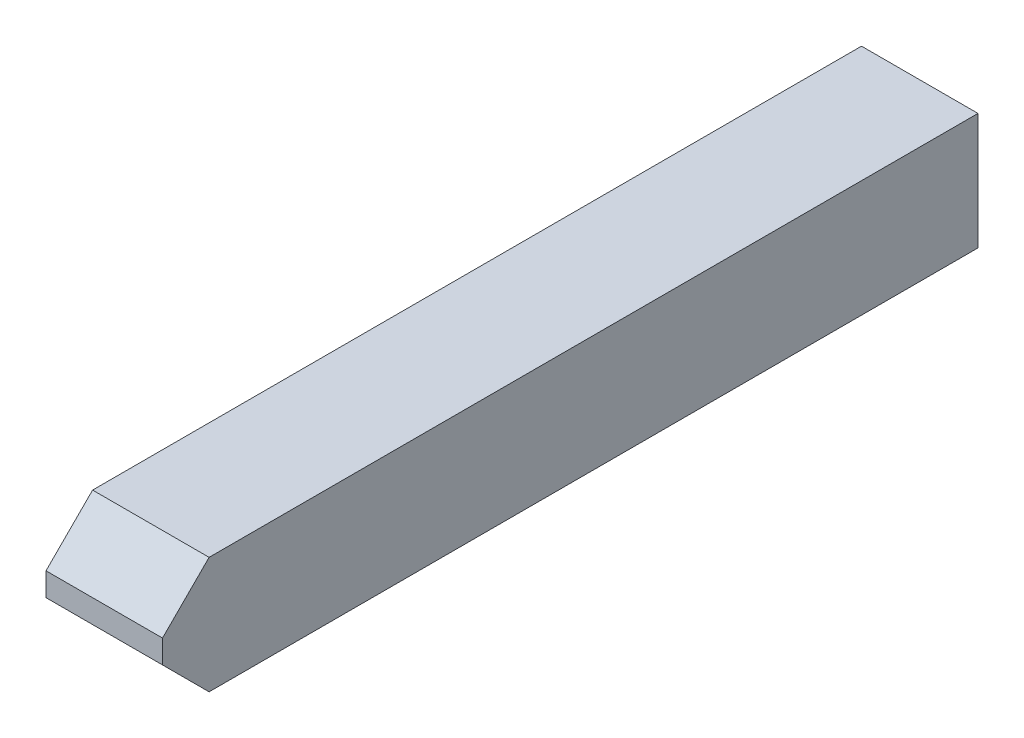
ISO-10303-21;
HEADER;
FILE_DESCRIPTION(('STEP AP214'),'2;1');
FILE_NAME('part.step','',(''),(''),'','','');
FILE_SCHEMA(('AUTOMOTIVE_DESIGN { 1 0 10303 214 1 1 1 1 }'));
ENDSEC;
DATA;
#1=APPLICATION_CONTEXT('core data for automotive mechanical design processes');
#2=APPLICATION_PROTOCOL_DEFINITION('international standard','automotive_design',2000,#1);
#3=PRODUCT_CONTEXT('',#1,'mechanical');
#4=PRODUCT('Part','Part','',(#3));
#5=PRODUCT_RELATED_PRODUCT_CATEGORY('part','',(#4));
#6=PRODUCT_DEFINITION_FORMATION('','',#4);
#7=PRODUCT_DEFINITION_CONTEXT('part definition',#1,'design');
#8=PRODUCT_DEFINITION('design','',#6,#7);
#9=PRODUCT_DEFINITION_SHAPE('','',#8);
#10=(LENGTH_UNIT() NAMED_UNIT(*) SI_UNIT(.MILLI.,.METRE.));
#11=(NAMED_UNIT(*) PLANE_ANGLE_UNIT() SI_UNIT($,.RADIAN.));
#12=(NAMED_UNIT(*) SI_UNIT($,.STERADIAN.) SOLID_ANGLE_UNIT());
#13=UNCERTAINTY_MEASURE_WITH_UNIT(LENGTH_MEASURE(1.E-05),#10,'distance_accuracy_value','');
#14=(GEOMETRIC_REPRESENTATION_CONTEXT(3) GLOBAL_UNCERTAINTY_ASSIGNED_CONTEXT((#13)) GLOBAL_UNIT_ASSIGNED_CONTEXT((#10,
#11,#12)) REPRESENTATION_CONTEXT('',''));
#15=CARTESIAN_POINT('',(0.,0.,0.));
#16=DIRECTION('',(0.,0.,1.));
#17=DIRECTION('',(1.,0.,0.));
#18=AXIS2_PLACEMENT_3D('',#15,#16,#17);
#19=CARTESIAN_POINT('',(2.,4.8,22.5));
#20=DIRECTION('',(1.,0.,0.));
#21=DIRECTION('',(0.,0.,-1.));
#22=AXIS2_PLACEMENT_3D('',#19,#20,#21);
#23=PLANE('',#22);
#24=DIRECTION('',(0.,1.,0.));
#25=VECTOR('',#24,1.);
#26=CARTESIAN_POINT('',(2.,4.8,26.));
#27=LINE('',#26,#25);
#28=CARTESIAN_POINT('',(2.,-1.,26.));
#29=VERTEX_POINT('',#28);
#30=CARTESIAN_POINT('',(2.,-0.9,26.));
#31=VERTEX_POINT('',#30);
#32=EDGE_CURVE('E74',#29,#31,#27,.T.);
#33=ORIENTED_EDGE('',*,*,#32,.F.);
#34=DIRECTION('',(0.,-0.707106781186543,-0.707106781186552));
#35=VECTOR('',#34,1.);
#36=CARTESIAN_POINT('',(2.,-1.,26.));
#37=LINE('',#36,#35);
#38=CARTESIAN_POINT('',(2.,-1.2,25.8));
#39=VERTEX_POINT('',#38);
#40=EDGE_CURVE('E20',#29,#39,#37,.T.);
#41=ORIENTED_EDGE('',*,*,#40,.T.);
#42=DIRECTION('',(0.,0.,-1.));
#43=VECTOR('',#42,1.);
#44=CARTESIAN_POINT('',(2.,-1.2,22.5));
#45=LINE('',#44,#43);
#46=CARTESIAN_POINT('',(2.,-1.2,22.5));
#47=VERTEX_POINT('',#46);
#48=EDGE_CURVE('E101',#47,#39,#45,.F.);
#49=ORIENTED_EDGE('',*,*,#48,.F.);
#50=DIRECTION('',(0.,1.,0.));
#51=VECTOR('',#50,1.);
#52=CARTESIAN_POINT('',(2.,4.8,22.5));
#53=LINE('',#52,#51);
#54=CARTESIAN_POINT('',(2.,-0.7,22.5));
#55=VERTEX_POINT('',#54);
#56=EDGE_CURVE('E94',#47,#55,#53,.T.);
#57=ORIENTED_EDGE('',*,*,#56,.T.);
#58=DIRECTION('',(0.,0.,1.));
#59=VECTOR('',#58,1.);
#60=CARTESIAN_POINT('',(2.,-0.7,22.5));
#61=LINE('',#60,#59);
#62=CARTESIAN_POINT('',(2.,-0.7,25.8));
#63=VERTEX_POINT('',#62);
#64=EDGE_CURVE('E68',#63,#55,#61,.F.);
#65=ORIENTED_EDGE('',*,*,#64,.F.);
#66=DIRECTION('',(0.,-0.707106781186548,0.707106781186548));
#67=VECTOR('',#66,1.);
#68=CARTESIAN_POINT('',(2.,-0.7,25.8));
#69=LINE('',#68,#67);
#70=EDGE_CURVE('E81',#31,#63,#69,.F.);
#71=ORIENTED_EDGE('',*,*,#70,.F.);
#72=EDGE_LOOP('',(#33,#41,#49,#57,#65,#71));
#73=FACE_BOUND('',#72,.T.);
#74=ADVANCED_FACE('F17',(#73),#23,.T.);
#75=CARTESIAN_POINT('',(2.,4.8,26.));
#76=DIRECTION('',(0.,0.,1.));
#77=DIRECTION('',(1.,0.,0.));
#78=AXIS2_PLACEMENT_3D('',#75,#76,#77);
#79=PLANE('',#78);
#80=DIRECTION('',(0.,1.,0.));
#81=VECTOR('',#80,1.);
#82=CARTESIAN_POINT('',(1.5,5.3,26.));
#83=LINE('',#82,#81);
#84=CARTESIAN_POINT('',(1.5,-0.999999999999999,26.));
#85=VERTEX_POINT('',#84);
#86=CARTESIAN_POINT('',(1.5,-0.9,26.));
#87=VERTEX_POINT('',#86);
#88=EDGE_CURVE('E105',#85,#87,#83,.T.);
#89=ORIENTED_EDGE('',*,*,#88,.F.);
#90=DIRECTION('',(1.,0.,0.));
#91=VECTOR('',#90,1.);
#92=CARTESIAN_POINT('',(1.4,-0.999999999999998,26.));
#93=LINE('',#92,#91);
#94=EDGE_CURVE('E80',#29,#85,#93,.F.);
#95=ORIENTED_EDGE('',*,*,#94,.F.);
#96=ORIENTED_EDGE('',*,*,#32,.T.);
#97=DIRECTION('',(1.,0.,0.));
#98=VECTOR('',#97,1.);
#99=CARTESIAN_POINT('',(2.1,-0.900000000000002,26.));
#100=LINE('',#99,#98);
#101=EDGE_CURVE('E77',#87,#31,#100,.T.);
#102=ORIENTED_EDGE('',*,*,#101,.F.);
#103=EDGE_LOOP('',(#89,#95,#96,#102));
#104=FACE_BOUND('',#103,.T.);
#105=ADVANCED_FACE('F75',(#104),#79,.T.);
#106=CARTESIAN_POINT('',(2.1,-0.7,25.8));
#107=DIRECTION('',(0.,0.707106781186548,0.707106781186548));
#108=DIRECTION('',(0.,-0.707106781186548,0.707106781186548));
#109=AXIS2_PLACEMENT_3D('',#106,#107,#108);
#110=PLANE('',#109);
#111=ORIENTED_EDGE('',*,*,#70,.T.);
#112=DIRECTION('',(1.,0.,0.));
#113=VECTOR('',#112,1.);
#114=CARTESIAN_POINT('',(2.,-0.7,25.8));
#115=LINE('',#114,#113);
#116=CARTESIAN_POINT('',(1.5,-0.7,25.8));
#117=VERTEX_POINT('',#116);
#118=EDGE_CURVE('E92',#117,#63,#115,.T.);
#119=ORIENTED_EDGE('',*,*,#118,.F.);
#120=DIRECTION('',(0.,0.707106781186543,-0.707106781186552));
#121=VECTOR('',#120,1.);
#122=CARTESIAN_POINT('',(1.5,-0.9,26.));
#123=LINE('',#122,#121);
#124=EDGE_CURVE('E87',#87,#117,#123,.T.);
#125=ORIENTED_EDGE('',*,*,#124,.F.);
#126=ORIENTED_EDGE('',*,*,#101,.T.);
#127=EDGE_LOOP('',(#111,#119,#125,#126));
#128=FACE_BOUND('',#127,.T.);
#129=ADVANCED_FACE('F85',(#128),#110,.T.);
#130=CARTESIAN_POINT('',(2.,-0.7,22.5));
#131=DIRECTION('',(0.,1.,0.));
#132=DIRECTION('',(0.,0.,1.));
#133=AXIS2_PLACEMENT_3D('',#130,#131,#132);
#134=PLANE('',#133);
#135=DIRECTION('',(0.,0.,1.));
#136=VECTOR('',#135,1.);
#137=CARTESIAN_POINT('',(1.5,-0.7,22.5));
#138=LINE('',#137,#136);
#139=CARTESIAN_POINT('',(1.5,-0.7,22.5));
#140=VERTEX_POINT('',#139);
#141=EDGE_CURVE('E108',#117,#140,#138,.F.);
#142=ORIENTED_EDGE('',*,*,#141,.F.);
#143=ORIENTED_EDGE('',*,*,#118,.T.);
#144=ORIENTED_EDGE('',*,*,#64,.T.);
#145=DIRECTION('',(1.,0.,0.));
#146=VECTOR('',#145,1.);
#147=CARTESIAN_POINT('',(2.,-0.7,22.5));
#148=LINE('',#147,#146);
#149=EDGE_CURVE('E96',#55,#140,#148,.F.);
#150=ORIENTED_EDGE('',*,*,#149,.T.);
#151=EDGE_LOOP('',(#142,#143,#144,#150));
#152=FACE_BOUND('',#151,.T.);
#153=ADVANCED_FACE('F137',(#152),#134,.T.);
#154=CARTESIAN_POINT('',(2.,4.8,22.5));
#155=DIRECTION('',(0.,0.,1.));
#156=DIRECTION('',(1.,0.,0.));
#157=AXIS2_PLACEMENT_3D('',#154,#155,#156);
#158=PLANE('',#157);
#159=DIRECTION('',(0.,1.,0.));
#160=VECTOR('',#159,1.);
#161=CARTESIAN_POINT('',(1.5,5.3,22.5));
#162=LINE('',#161,#160);
#163=CARTESIAN_POINT('',(1.5,-1.2,22.5));
#164=VERTEX_POINT('',#163);
#165=EDGE_CURVE('E111',#140,#164,#162,.F.);
#166=ORIENTED_EDGE('',*,*,#165,.F.);
#167=ORIENTED_EDGE('',*,*,#149,.F.);
#168=ORIENTED_EDGE('',*,*,#56,.F.);
#169=DIRECTION('',(1.,0.,0.));
#170=VECTOR('',#169,1.);
#171=CARTESIAN_POINT('',(1.5,-1.2,22.5));
#172=LINE('',#171,#170);
#173=EDGE_CURVE('E98',#164,#47,#172,.T.);
#174=ORIENTED_EDGE('',*,*,#173,.F.);
#175=EDGE_LOOP('',(#166,#167,#168,#174));
#176=FACE_BOUND('',#175,.T.);
#177=ADVANCED_FACE('F121',(#176),#158,.F.);
#178=CARTESIAN_POINT('',(1.5,-1.2,22.5));
#179=DIRECTION('',(0.,-1.,0.));
#180=DIRECTION('',(0.,0.,-1.));
#181=AXIS2_PLACEMENT_3D('',#178,#179,#180);
#182=PLANE('',#181);
#183=ORIENTED_EDGE('',*,*,#48,.T.);
#184=DIRECTION('',(1.,0.,0.));
#185=VECTOR('',#184,1.);
#186=CARTESIAN_POINT('',(1.4,-1.2,25.8));
#187=LINE('',#186,#185);
#188=CARTESIAN_POINT('',(1.5,-1.2,25.8));
#189=VERTEX_POINT('',#188);
#190=EDGE_CURVE('E35',#189,#39,#187,.T.);
#191=ORIENTED_EDGE('',*,*,#190,.F.);
#192=DIRECTION('',(0.,0.,1.));
#193=VECTOR('',#192,1.);
#194=CARTESIAN_POINT('',(1.5,-1.2,22.5));
#195=LINE('',#194,#193);
#196=EDGE_CURVE('E26',#164,#189,#195,.T.);
#197=ORIENTED_EDGE('',*,*,#196,.F.);
#198=ORIENTED_EDGE('',*,*,#173,.T.);
#199=EDGE_LOOP('',(#183,#191,#197,#198));
#200=FACE_BOUND('',#199,.T.);
#201=ADVANCED_FACE('F118',(#200),#182,.T.);
#202=CARTESIAN_POINT('',(1.4,-1.2,25.8));
#203=DIRECTION('',(0.,-0.707106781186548,0.707106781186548));
#204=DIRECTION('',(0.,-0.707106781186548,-0.707106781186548));
#205=AXIS2_PLACEMENT_3D('',#202,#203,#204);
#206=PLANE('',#205);
#207=DIRECTION('',(0.,0.707106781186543,0.707106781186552));
#208=VECTOR('',#207,1.);
#209=CARTESIAN_POINT('',(1.5,-1.2,25.8));
#210=LINE('',#209,#208);
#211=EDGE_CURVE('E11',#189,#85,#210,.T.);
#212=ORIENTED_EDGE('',*,*,#211,.F.);
#213=ORIENTED_EDGE('',*,*,#190,.T.);
#214=ORIENTED_EDGE('',*,*,#40,.F.);
#215=ORIENTED_EDGE('',*,*,#94,.T.);
#216=EDGE_LOOP('',(#212,#213,#214,#215));
#217=FACE_BOUND('',#216,.T.);
#218=ADVANCED_FACE('F124',(#217),#206,.T.);
#219=CARTESIAN_POINT('',(1.5,5.3,22.5));
#220=DIRECTION('',(-1.,0.,0.));
#221=DIRECTION('',(0.,0.,1.));
#222=AXIS2_PLACEMENT_3D('',#219,#220,#221);
#223=PLANE('',#222);
#224=ORIENTED_EDGE('',*,*,#196,.T.);
#225=ORIENTED_EDGE('',*,*,#211,.T.);
#226=ORIENTED_EDGE('',*,*,#88,.T.);
#227=ORIENTED_EDGE('',*,*,#124,.T.);
#228=ORIENTED_EDGE('',*,*,#141,.T.);
#229=ORIENTED_EDGE('',*,*,#165,.T.);
#230=EDGE_LOOP('',(#224,#225,#226,#227,#228,#229));
#231=FACE_BOUND('',#230,.T.);
#232=ADVANCED_FACE('F116',(#231),#223,.T.);
#233=CLOSED_SHELL('',(#74,#105,#129,#153,#177,#201,#218,#232));
#234=MANIFOLD_SOLID_BREP('B1',#233);
#235=ADVANCED_BREP_SHAPE_REPRESENTATION('',(#18,#234),#14);
#236=SHAPE_DEFINITION_REPRESENTATION(#9,#235);
ENDSEC;
END-ISO-10303-21;
